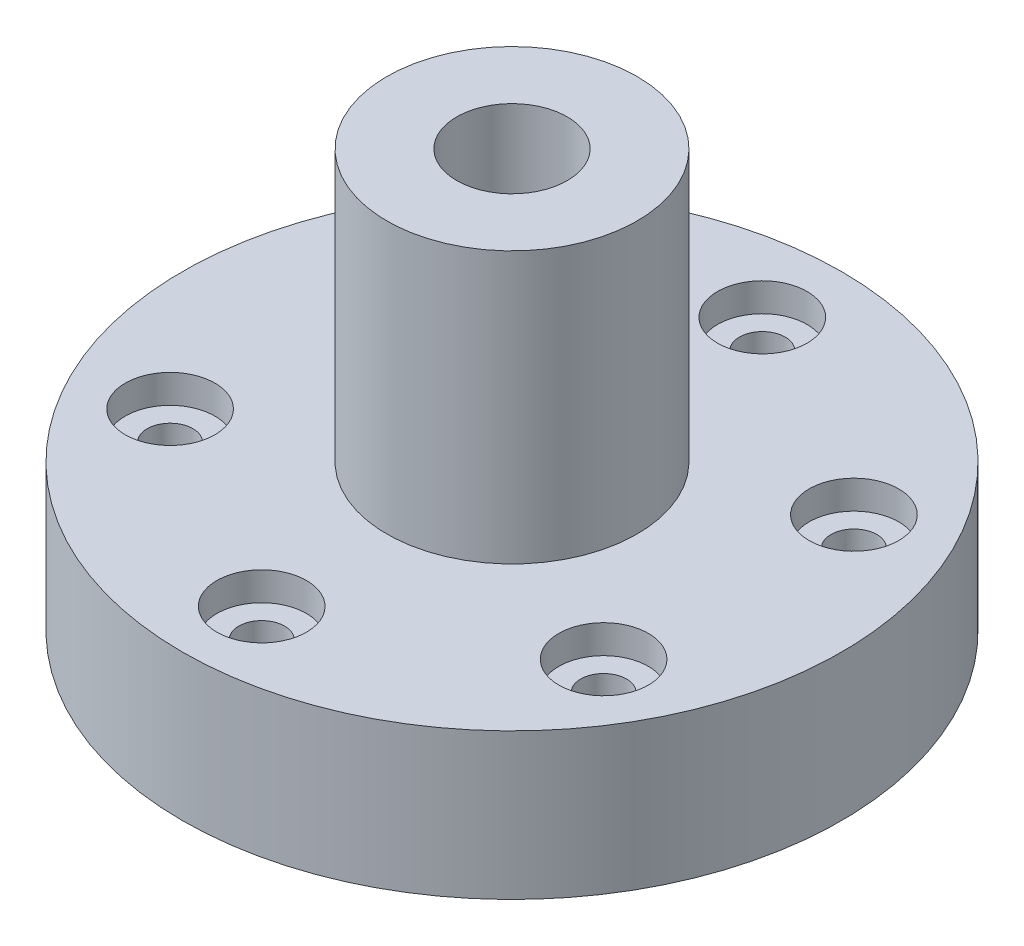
from build123d import *

# Parameters (mm, degrees)
M30X3_5_TAPPED_HOLE1_D                   = 26.5
M30X3_5_TAPPED_HOLE1_DEPTH               = 57.5
M30X3_5_TAPPED_HOLE1_TIP                 = 7.961403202
CBORE_FOR_M10_HEX_HEAD_BOLT1_D           = 11
CBORE_FOR_M10_HEX_HEAD_BOLT1_CBORE_D     = 21.48
CBORE_FOR_M10_HEX_HEAD_BOLT1_CBORE_DEPTH = 6.85
CIRPATTERN1_COUNT                        = 6


with BuildPart() as part:
    # Sketch1 → Revolve1 (revolve)
    with BuildSketch(Plane.XY, mode=Mode.PRIVATE) as revolve1_sk:
        Polygon((-29, 0), (-79, 0), (-79, 35), (-30, 35), (-30, 100), (0, 100), (0, 20), (-29, 20), align=None)
    revolve(revolve1_sk.sketch.rotate(Axis((0, 20, 0), (0, 1, 0)), 270), axis=Axis((0, 20, 0), (0, 1, 0)))

    # M30x3.5 Tapped Hole1
    with Locations(Plane(origin=(0, 100, 0), x_dir=(-1, 0, 0), z_dir=(0, 1, 0))):
        with Locations((0, 0)):
            Hole(M30X3_5_TAPPED_HOLE1_D / 2, depth=M30X3_5_TAPPED_HOLE1_DEPTH)
            with Locations((0, 0, -(M30X3_5_TAPPED_HOLE1_DEPTH + M30X3_5_TAPPED_HOLE1_TIP / 2))):  # 118° drill point
                Cone(0, M30X3_5_TAPPED_HOLE1_D / 2, M30X3_5_TAPPED_HOLE1_TIP, mode=Mode.SUBTRACT)

    # CBORE for M10 Hex Head Bolt1 (through all)
    with Locations(Plane(origin=(0, 35, 0), x_dir=(-1, 0, 0), z_dir=(0, 1, 0))):
        with Locations((0, -60)):
            cbore_for_m10_hex_head_bolt1 = CounterBoreHole(CBORE_FOR_M10_HEX_HEAD_BOLT1_D / 2, CBORE_FOR_M10_HEX_HEAD_BOLT1_CBORE_D / 2, CBORE_FOR_M10_HEX_HEAD_BOLT1_CBORE_DEPTH)

    # CirPattern1: CBORE for M10 Hex Head Bolt1 ×6 about axis
    cirpattern1_axis = Axis((0, 0, 0), (0, 1, 0))
    for i in range(1, CIRPATTERN1_COUNT):
        add(cbore_for_m10_hex_head_bolt1.rotate(cirpattern1_axis, i * 360 / CIRPATTERN1_COUNT), mode=Mode.SUBTRACT)


solid = part.part
